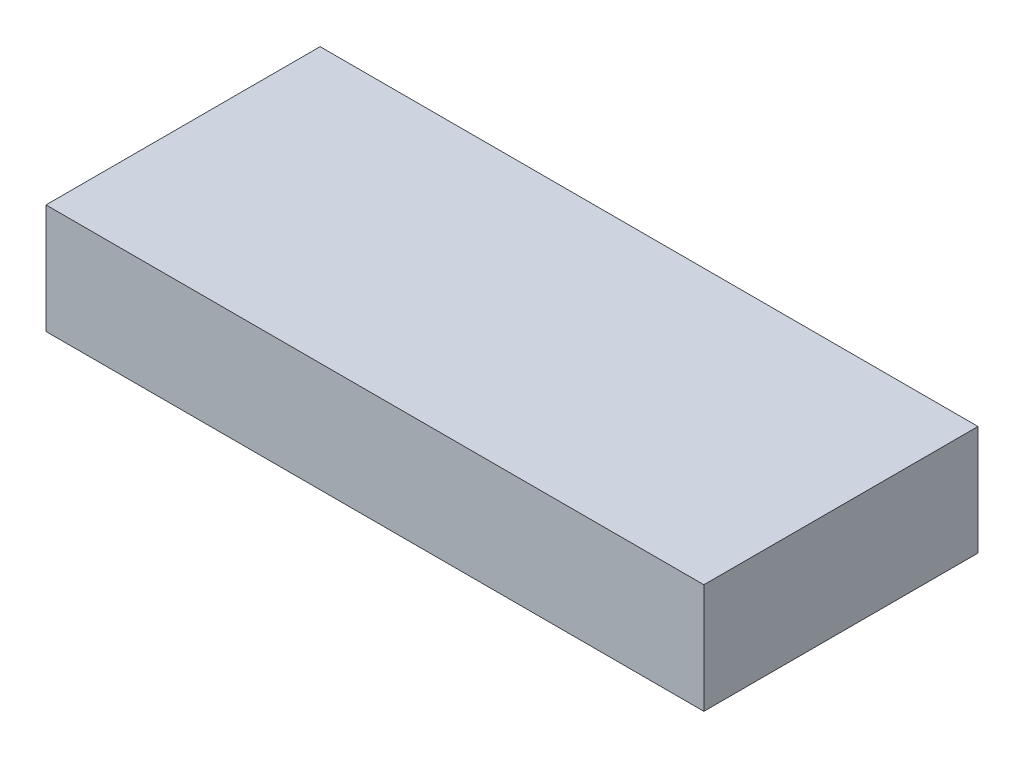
from build123d import *

# Parameters (mm, degrees)
SKETCH_1_W      = 60
SKETCH_1_H      = 25
EXTRUDE_1_DEPTH = 10


with BuildPart() as part:
    # Sketch 1 → Extrude 1 (new body)
    with BuildSketch(Plane(origin=(0, 0, 0), x_dir=(1, 0, 0), z_dir=(0, 1, 0))):
        Rectangle(SKETCH_1_W, SKETCH_1_H)
    extrude(amount=EXTRUDE_1_DEPTH)


solid = part.part
